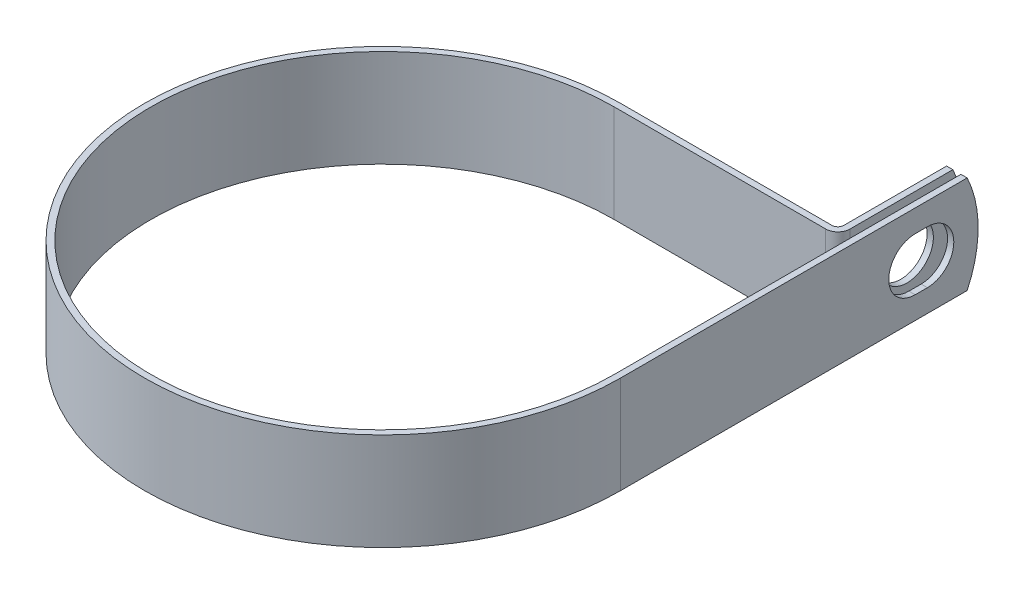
ISO-10303-21;
HEADER;
FILE_DESCRIPTION(('STEP AP214'),'2;1');
FILE_NAME('part.step','',(''),(''),'','','');
FILE_SCHEMA(('AUTOMOTIVE_DESIGN { 1 0 10303 214 1 1 1 1 }'));
ENDSEC;
DATA;
#1=APPLICATION_CONTEXT('core data for automotive mechanical design processes');
#2=APPLICATION_PROTOCOL_DEFINITION('international standard','automotive_design',2000,#1);
#3=PRODUCT_CONTEXT('',#1,'mechanical');
#4=PRODUCT('Part','Part','',(#3));
#5=PRODUCT_RELATED_PRODUCT_CATEGORY('part','',(#4));
#6=PRODUCT_DEFINITION_FORMATION('','',#4);
#7=PRODUCT_DEFINITION_CONTEXT('part definition',#1,'design');
#8=PRODUCT_DEFINITION('design','',#6,#7);
#9=PRODUCT_DEFINITION_SHAPE('','',#8);
#10=(LENGTH_UNIT() NAMED_UNIT(*) SI_UNIT(.MILLI.,.METRE.));
#11=(NAMED_UNIT(*) PLANE_ANGLE_UNIT() SI_UNIT($,.RADIAN.));
#12=(NAMED_UNIT(*) SI_UNIT($,.STERADIAN.) SOLID_ANGLE_UNIT());
#13=UNCERTAINTY_MEASURE_WITH_UNIT(LENGTH_MEASURE(1.E-05),#10,'distance_accuracy_value','');
#14=(GEOMETRIC_REPRESENTATION_CONTEXT(3) GLOBAL_UNCERTAINTY_ASSIGNED_CONTEXT((#13)) GLOBAL_UNIT_ASSIGNED_CONTEXT((#10,
#11,#12)) REPRESENTATION_CONTEXT('',''));
#15=CARTESIAN_POINT('',(0.,0.,0.));
#16=DIRECTION('',(0.,0.,1.));
#17=DIRECTION('',(1.,0.,0.));
#18=AXIS2_PLACEMENT_3D('',#15,#16,#17);
#19=CARTESIAN_POINT('',(45.2374,9.525,0.));
#20=DIRECTION('',(-1.,0.,0.));
#21=DIRECTION('',(0.,0.,1.));
#22=AXIS2_PLACEMENT_3D('',#19,#20,#21);
#23=PLANE('',#22);
#24=DIRECTION('',(0.,0.,-1.));
#25=VECTOR('',#24,1.);
#26=CARTESIAN_POINT('',(45.2374,-5.1562,-57.5309999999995));
#27=LINE('',#26,#25);
#28=CARTESIAN_POINT('',(45.2374,-5.1562,-57.5309999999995));
#29=VERTEX_POINT('',#28);
#30=CARTESIAN_POINT('',(45.2374,-5.1562,-59.9186000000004));
#31=VERTEX_POINT('',#30);
#32=EDGE_CURVE('E236',#29,#31,#27,.T.);
#33=ORIENTED_EDGE('',*,*,#32,.T.);
#34=CARTESIAN_POINT('',(45.2374,0.,-59.9185999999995));
#35=DIRECTION('',(-1.,0.,0.));
#36=DIRECTION('',(0.,0.,1.));
#37=AXIS2_PLACEMENT_3D('',#34,#35,#36);
#38=CIRCLE('',#37,5.1562);
#39=CARTESIAN_POINT('',(45.2374,5.1562,-59.9186000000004));
#40=VERTEX_POINT('',#39);
#41=EDGE_CURVE('E257',#31,#40,#38,.F.);
#42=ORIENTED_EDGE('',*,*,#41,.T.);
#43=DIRECTION('',(0.,0.,1.));
#44=VECTOR('',#43,1.);
#45=CARTESIAN_POINT('',(45.2374,5.1562,-57.5309999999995));
#46=LINE('',#45,#44);
#47=CARTESIAN_POINT('',(45.2374,5.1562,-57.5309999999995));
#48=VERTEX_POINT('',#47);
#49=EDGE_CURVE('E253',#40,#48,#46,.T.);
#50=ORIENTED_EDGE('',*,*,#49,.T.);
#51=CARTESIAN_POINT('',(45.2374,0.,-57.5309999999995));
#52=DIRECTION('',(-1.,0.,0.));
#53=DIRECTION('',(0.,0.,1.));
#54=AXIS2_PLACEMENT_3D('',#51,#52,#53);
#55=CIRCLE('',#54,5.1562);
#56=EDGE_CURVE('E248',#48,#29,#55,.F.);
#57=ORIENTED_EDGE('',*,*,#56,.T.);
#58=EDGE_LOOP('',(#33,#42,#50,#57));
#59=FACE_BOUND('',#58,.T.);
#60=CARTESIAN_POINT('',(45.2374,0.,-47.5996));
#61=DIRECTION('',(-1.,0.,0.));
#62=DIRECTION('',(0.,0.,1.));
#63=AXIS2_PLACEMENT_3D('',#60,#61,#62);
#64=CIRCLE('',#63,22.225);
#65=CARTESIAN_POINT('',(45.2374,9.525,-67.6800631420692));
#66=VERTEX_POINT('',#65);
#67=CARTESIAN_POINT('',(45.2374,-9.525,-67.6800631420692));
#68=VERTEX_POINT('',#67);
#69=EDGE_CURVE('E75',#66,#68,#64,.T.);
#70=ORIENTED_EDGE('',*,*,#69,.T.);
#71=DIRECTION('',(0.,0.,-1.));
#72=VECTOR('',#71,1.);
#73=CARTESIAN_POINT('',(45.2374,-9.525,0.));
#74=LINE('',#73,#72);
#75=CARTESIAN_POINT('',(45.2374,-9.525,0.));
#76=VERTEX_POINT('',#75);
#77=EDGE_CURVE('E271',#76,#68,#74,.T.);
#78=ORIENTED_EDGE('',*,*,#77,.F.);
#79=DIRECTION('',(0.,-1.,0.));
#80=VECTOR('',#79,1.);
#81=CARTESIAN_POINT('',(45.2374,9.525,0.));
#82=LINE('',#81,#80);
#83=CARTESIAN_POINT('',(45.2374,9.525,0.));
#84=VERTEX_POINT('',#83);
#85=EDGE_CURVE('E218',#84,#76,#82,.T.);
#86=ORIENTED_EDGE('',*,*,#85,.F.);
#87=DIRECTION('',(0.,0.,-1.));
#88=VECTOR('',#87,1.);
#89=CARTESIAN_POINT('',(45.2374,9.525,-45.2374));
#90=LINE('',#89,#88);
#91=EDGE_CURVE('E273',#84,#66,#90,.T.);
#92=ORIENTED_EDGE('',*,*,#91,.T.);
#93=EDGE_LOOP('',(#70,#78,#86,#92));
#94=FACE_BOUND('',#93,.T.);
#95=ADVANCED_FACE('F54',(#59,#94),#23,.T.);
#96=CARTESIAN_POINT('',(43.6626,9.525,-69.8246));
#97=DIRECTION('',(1.,0.,0.));
#98=DIRECTION('',(0.,0.,-1.));
#99=AXIS2_PLACEMENT_3D('',#96,#97,#98);
#100=PLANE('',#99);
#101=CARTESIAN_POINT('',(43.6626,0.,-58.7248));
#102=DIRECTION('',(1.,0.,0.));
#103=DIRECTION('',(0.,0.,-1.));
#104=AXIS2_PLACEMENT_3D('',#101,#102,#103);
#105=CIRCLE('',#104,5.1562);
#106=CARTESIAN_POINT('',(43.6626,0.,-63.881));
#107=VERTEX_POINT('',#106);
#108=EDGE_CURVE('E268',#107,#107,#105,.F.);
#109=ORIENTED_EDGE('',*,*,#108,.T.);
#110=EDGE_LOOP('',(#109));
#111=FACE_BOUND('',#110,.T.);
#112=DIRECTION('',(0.,0.,1.));
#113=VECTOR('',#112,1.);
#114=CARTESIAN_POINT('',(43.6626,-9.525,-69.8246));
#115=LINE('',#114,#113);
#116=CARTESIAN_POINT('',(43.6626,-9.525,-67.6800631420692));
#117=VERTEX_POINT('',#116);
#118=CARTESIAN_POINT('',(43.6626,-9.525,-47.61484));
#119=VERTEX_POINT('',#118);
#120=EDGE_CURVE('E184',#117,#119,#115,.T.);
#121=ORIENTED_EDGE('',*,*,#120,.F.);
#122=CARTESIAN_POINT('',(43.6626,0.,-47.5996));
#123=DIRECTION('',(1.,0.,0.));
#124=DIRECTION('',(0.,0.,-1.));
#125=AXIS2_PLACEMENT_3D('',#122,#123,#124);
#126=CIRCLE('',#125,22.225);
#127=CARTESIAN_POINT('',(43.6626,9.525,-67.6800631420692));
#128=VERTEX_POINT('',#127);
#129=EDGE_CURVE('E176',#117,#128,#126,.T.);
#130=ORIENTED_EDGE('',*,*,#129,.T.);
#131=DIRECTION('',(0.,0.,1.));
#132=VECTOR('',#131,1.);
#133=CARTESIAN_POINT('',(43.6626,9.525,-69.8246));
#134=LINE('',#133,#132);
#135=CARTESIAN_POINT('',(43.6626,9.525,-47.61484));
#136=VERTEX_POINT('',#135);
#137=EDGE_CURVE('E224',#128,#136,#134,.T.);
#138=ORIENTED_EDGE('',*,*,#137,.T.);
#139=DIRECTION('',(0.,-1.,0.));
#140=VECTOR('',#139,1.);
#141=CARTESIAN_POINT('',(43.6626,9.525,-47.61484));
#142=LINE('',#141,#140);
#143=EDGE_CURVE('E211',#136,#119,#142,.T.);
#144=ORIENTED_EDGE('',*,*,#143,.T.);
#145=EDGE_LOOP('',(#121,#130,#138,#144));
#146=FACE_BOUND('',#145,.T.);
#147=ADVANCED_FACE('F226',(#111,#146),#100,.T.);
#148=CARTESIAN_POINT('',(42.4434,9.525,-69.8246));
#149=DIRECTION('',(1.,0.,0.));
#150=DIRECTION('',(0.,0.,-1.));
#151=AXIS2_PLACEMENT_3D('',#148,#149,#150);
#152=PLANE('',#151);
#153=CARTESIAN_POINT('',(42.4434,0.,-58.7248));
#154=DIRECTION('',(-1.,0.,0.));
#155=DIRECTION('',(0.,0.,1.));
#156=AXIS2_PLACEMENT_3D('',#153,#154,#155);
#157=CIRCLE('',#156,5.1562);
#158=CARTESIAN_POINT('',(42.4434,0.,-53.5686));
#159=VERTEX_POINT('',#158);
#160=EDGE_CURVE('E265',#159,#159,#157,.T.);
#161=ORIENTED_EDGE('',*,*,#160,.F.);
#162=EDGE_LOOP('',(#161));
#163=FACE_BOUND('',#162,.T.);
#164=CARTESIAN_POINT('',(42.4434,0.,-47.5996));
#165=DIRECTION('',(-1.,0.,0.));
#166=DIRECTION('',(0.,0.,1.));
#167=AXIS2_PLACEMENT_3D('',#164,#165,#166);
#168=CIRCLE('',#167,22.225);
#169=CARTESIAN_POINT('',(42.4434,9.525,-67.6800631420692));
#170=VERTEX_POINT('',#169);
#171=CARTESIAN_POINT('',(42.4434,-9.525,-67.6800631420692));
#172=VERTEX_POINT('',#171);
#173=EDGE_CURVE('E67',#170,#172,#168,.T.);
#174=ORIENTED_EDGE('',*,*,#173,.T.);
#175=DIRECTION('',(0.,0.,1.));
#176=VECTOR('',#175,1.);
#177=CARTESIAN_POINT('',(42.4434,-9.525,-69.8246));
#178=LINE('',#177,#176);
#179=CARTESIAN_POINT('',(42.4434,-9.525,-47.61484));
#180=VERTEX_POINT('',#179);
#181=EDGE_CURVE('E167',#172,#180,#178,.T.);
#182=ORIENTED_EDGE('',*,*,#181,.T.);
#183=DIRECTION('',(0.,-1.,0.));
#184=VECTOR('',#183,1.);
#185=CARTESIAN_POINT('',(42.4434,9.525,-47.61484));
#186=LINE('',#185,#184);
#187=CARTESIAN_POINT('',(42.4434,9.525,-47.61484));
#188=VERTEX_POINT('',#187);
#189=EDGE_CURVE('E209',#188,#180,#186,.T.);
#190=ORIENTED_EDGE('',*,*,#189,.F.);
#191=DIRECTION('',(0.,0.,1.));
#192=VECTOR('',#191,1.);
#193=CARTESIAN_POINT('',(42.4434,9.525,-69.8246));
#194=LINE('',#193,#192);
#195=EDGE_CURVE('E169',#170,#188,#194,.T.);
#196=ORIENTED_EDGE('',*,*,#195,.F.);
#197=EDGE_LOOP('',(#174,#182,#190,#196));
#198=FACE_BOUND('',#197,.T.);
#199=ADVANCED_FACE('F164',(#163,#198),#152,.F.);
#200=CARTESIAN_POINT('',(46.4566,9.525,0.));
#201=DIRECTION('',(-1.,0.,0.));
#202=DIRECTION('',(0.,0.,1.));
#203=AXIS2_PLACEMENT_3D('',#200,#201,#202);
#204=PLANE('',#203);
#205=CARTESIAN_POINT('',(46.4566,0.,-59.9185999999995));
#206=DIRECTION('',(1.,0.,0.));
#207=DIRECTION('',(0.,0.,-1.));
#208=AXIS2_PLACEMENT_3D('',#205,#206,#207);
#209=CIRCLE('',#208,5.1562);
#210=CARTESIAN_POINT('',(46.4566,-5.1562,-59.9186000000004));
#211=VERTEX_POINT('',#210);
#212=CARTESIAN_POINT('',(46.4566,5.1562,-59.9186000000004));
#213=VERTEX_POINT('',#212);
#214=EDGE_CURVE('E237',#211,#213,#209,.T.);
#215=ORIENTED_EDGE('',*,*,#214,.F.);
#216=DIRECTION('',(0.,0.,-1.));
#217=VECTOR('',#216,1.);
#218=CARTESIAN_POINT('',(46.4566,-5.1562,-57.5309999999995));
#219=LINE('',#218,#217);
#220=CARTESIAN_POINT('',(46.4566,-5.1562,-57.5309999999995));
#221=VERTEX_POINT('',#220);
#222=EDGE_CURVE('E240',#221,#211,#219,.T.);
#223=ORIENTED_EDGE('',*,*,#222,.F.);
#224=CARTESIAN_POINT('',(46.4566,0.,-57.5309999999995));
#225=DIRECTION('',(1.,0.,0.));
#226=DIRECTION('',(0.,0.,-1.));
#227=AXIS2_PLACEMENT_3D('',#224,#225,#226);
#228=CIRCLE('',#227,5.1562);
#229=CARTESIAN_POINT('',(46.4566,5.1562,-57.5309999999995));
#230=VERTEX_POINT('',#229);
#231=EDGE_CURVE('E230',#230,#221,#228,.T.);
#232=ORIENTED_EDGE('',*,*,#231,.F.);
#233=DIRECTION('',(0.,0.,1.));
#234=VECTOR('',#233,1.);
#235=CARTESIAN_POINT('',(46.4566,5.1562,-57.5309999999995));
#236=LINE('',#235,#234);
#237=EDGE_CURVE('E234',#213,#230,#236,.T.);
#238=ORIENTED_EDGE('',*,*,#237,.F.);
#239=EDGE_LOOP('',(#215,#223,#232,#238));
#240=FACE_BOUND('',#239,.T.);
#241=DIRECTION('',(0.,0.,-1.));
#242=VECTOR('',#241,1.);
#243=CARTESIAN_POINT('',(46.4566,-9.525,0.));
#244=LINE('',#243,#242);
#245=CARTESIAN_POINT('',(46.4566,-9.525,0.));
#246=VERTEX_POINT('',#245);
#247=CARTESIAN_POINT('',(46.4566,-9.525,-67.6800631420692));
#248=VERTEX_POINT('',#247);
#249=EDGE_CURVE('E195',#246,#248,#244,.T.);
#250=ORIENTED_EDGE('',*,*,#249,.T.);
#251=CARTESIAN_POINT('',(46.4566,0.,-47.5996));
#252=DIRECTION('',(-1.,0.,0.));
#253=DIRECTION('',(0.,0.,1.));
#254=AXIS2_PLACEMENT_3D('',#251,#252,#253);
#255=CIRCLE('',#254,22.225);
#256=CARTESIAN_POINT('',(46.4566,9.525,-67.6800631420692));
#257=VERTEX_POINT('',#256);
#258=EDGE_CURVE('E170',#257,#248,#255,.T.);
#259=ORIENTED_EDGE('',*,*,#258,.F.);
#260=DIRECTION('',(0.,0.,-1.));
#261=VECTOR('',#260,1.);
#262=CARTESIAN_POINT('',(46.4566,9.525,-45.2374));
#263=LINE('',#262,#261);
#264=CARTESIAN_POINT('',(46.4566,9.525,0.));
#265=VERTEX_POINT('',#264);
#266=EDGE_CURVE('E198',#265,#257,#263,.T.);
#267=ORIENTED_EDGE('',*,*,#266,.F.);
#268=DIRECTION('',(0.,-1.,0.));
#269=VECTOR('',#268,1.);
#270=CARTESIAN_POINT('',(46.4566,9.525,0.));
#271=LINE('',#270,#269);
#272=EDGE_CURVE('E199',#265,#246,#271,.T.);
#273=ORIENTED_EDGE('',*,*,#272,.T.);
#274=EDGE_LOOP('',(#250,#259,#267,#273));
#275=FACE_BOUND('',#274,.T.);
#276=ADVANCED_FACE('F321',(#240,#275),#204,.F.);
#277=CARTESIAN_POINT('',(0.,-9.525,0.));
#278=DIRECTION('',(0.,1.,0.));
#279=DIRECTION('',(1.,0.,0.));
#280=AXIS2_PLACEMENT_3D('',#277,#278,#279);
#281=PLANE('',#280);
#282=DIRECTION('',(-1.,0.,0.));
#283=VECTOR('',#282,1.);
#284=CARTESIAN_POINT('',(46.4566,-9.525,-67.6800631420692));
#285=LINE('',#284,#283);
#286=EDGE_CURVE('E171',#248,#68,#285,.T.);
#287=ORIENTED_EDGE('',*,*,#286,.F.);
#288=ORIENTED_EDGE('',*,*,#249,.F.);
#289=CARTESIAN_POINT('',(0.,-9.525,0.));
#290=DIRECTION('',(0.,1.,0.));
#291=DIRECTION('',(1.,0.,0.));
#292=AXIS2_PLACEMENT_3D('',#289,#290,#291);
#293=CIRCLE('',#292,46.4566);
#294=CARTESIAN_POINT('',(0.,-9.525,-46.4566));
#295=VERTEX_POINT('',#294);
#296=EDGE_CURVE('E193',#295,#246,#293,.T.);
#297=ORIENTED_EDGE('',*,*,#296,.F.);
#298=DIRECTION('',(1.,0.,0.));
#299=VECTOR('',#298,1.);
#300=CARTESIAN_POINT('',(0.,-9.525,-46.4566));
#301=LINE('',#300,#299);
#302=CARTESIAN_POINT('',(41.28516,-9.525,-46.4566));
#303=VERTEX_POINT('',#302);
#304=EDGE_CURVE('E186',#303,#295,#301,.F.);
#305=ORIENTED_EDGE('',*,*,#304,.F.);
#306=CARTESIAN_POINT('',(41.28516,-9.525,-47.61484));
#307=DIRECTION('',(0.,1.,0.));
#308=DIRECTION('',(1.,0.,0.));
#309=AXIS2_PLACEMENT_3D('',#306,#307,#308);
#310=CIRCLE('',#309,1.15824000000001);
#311=EDGE_CURVE('E183',#180,#303,#310,.F.);
#312=ORIENTED_EDGE('',*,*,#311,.F.);
#313=ORIENTED_EDGE('',*,*,#181,.F.);
#314=DIRECTION('',(-1.,0.,0.));
#315=VECTOR('',#314,1.);
#316=CARTESIAN_POINT('',(46.4566,-9.525,-67.6800631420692));
#317=LINE('',#316,#315);
#318=EDGE_CURVE('E12',#117,#172,#317,.T.);
#319=ORIENTED_EDGE('',*,*,#318,.F.);
#320=ORIENTED_EDGE('',*,*,#120,.T.);
#321=CARTESIAN_POINT('',(41.28516,-9.525,-47.61484));
#322=DIRECTION('',(0.,-1.,0.));
#323=DIRECTION('',(0.,0.,1.));
#324=AXIS2_PLACEMENT_3D('',#321,#322,#323);
#325=CIRCLE('',#324,2.37744);
#326=CARTESIAN_POINT('',(41.28516,-9.525,-45.2374));
#327=VERTEX_POINT('',#326);
#328=EDGE_CURVE('E188',#119,#327,#325,.T.);
#329=ORIENTED_EDGE('',*,*,#328,.T.);
#330=DIRECTION('',(-1.,0.,0.));
#331=VECTOR('',#330,1.);
#332=CARTESIAN_POINT('',(0.,-9.525,-45.2374));
#333=LINE('',#332,#331);
#334=CARTESIAN_POINT('',(0.,-9.525,-45.2374));
#335=VERTEX_POINT('',#334);
#336=EDGE_CURVE('E298',#327,#335,#333,.T.);
#337=ORIENTED_EDGE('',*,*,#336,.T.);
#338=CARTESIAN_POINT('',(0.,-9.525,0.));
#339=DIRECTION('',(0.,1.,0.));
#340=DIRECTION('',(0.,0.,1.));
#341=AXIS2_PLACEMENT_3D('',#338,#339,#340);
#342=CIRCLE('',#341,45.2374);
#343=EDGE_CURVE('E295',#335,#76,#342,.T.);
#344=ORIENTED_EDGE('',*,*,#343,.T.);
#345=ORIENTED_EDGE('',*,*,#77,.T.);
#346=EDGE_LOOP('',(#287,#288,#297,#305,#312,#313,#319,#320,#329,#337,#344,#345));
#347=FACE_BOUND('',#346,.T.);
#348=ADVANCED_FACE('F181',(#347),#281,.F.);
#349=CARTESIAN_POINT('',(0.,9.525,0.));
#350=DIRECTION('',(0.,1.,0.));
#351=DIRECTION('',(1.,0.,0.));
#352=AXIS2_PLACEMENT_3D('',#349,#350,#351);
#353=PLANE('',#352);
#354=ORIENTED_EDGE('',*,*,#266,.T.);
#355=DIRECTION('',(-1.,0.,0.));
#356=VECTOR('',#355,1.);
#357=CARTESIAN_POINT('',(46.4566,9.525,-67.6800631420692));
#358=LINE('',#357,#356);
#359=EDGE_CURVE('E228',#257,#66,#358,.T.);
#360=ORIENTED_EDGE('',*,*,#359,.T.);
#361=ORIENTED_EDGE('',*,*,#91,.F.);
#362=CARTESIAN_POINT('',(0.,9.525,0.));
#363=DIRECTION('',(0.,1.,0.));
#364=DIRECTION('',(0.,0.,1.));
#365=AXIS2_PLACEMENT_3D('',#362,#363,#364);
#366=CIRCLE('',#365,45.2374);
#367=CARTESIAN_POINT('',(0.,9.525,-45.2374));
#368=VERTEX_POINT('',#367);
#369=EDGE_CURVE('E276',#368,#84,#366,.T.);
#370=ORIENTED_EDGE('',*,*,#369,.F.);
#371=DIRECTION('',(-1.,0.,0.));
#372=VECTOR('',#371,1.);
#373=CARTESIAN_POINT('',(0.,9.525,-45.2374));
#374=LINE('',#373,#372);
#375=CARTESIAN_POINT('',(41.28516,9.525,-45.2374));
#376=VERTEX_POINT('',#375);
#377=EDGE_CURVE('E279',#376,#368,#374,.T.);
#378=ORIENTED_EDGE('',*,*,#377,.F.);
#379=CARTESIAN_POINT('',(41.28516,9.525,-47.61484));
#380=DIRECTION('',(0.,-1.,0.));
#381=DIRECTION('',(0.,0.,1.));
#382=AXIS2_PLACEMENT_3D('',#379,#380,#381);
#383=CIRCLE('',#382,2.37744);
#384=EDGE_CURVE('E282',#136,#376,#383,.T.);
#385=ORIENTED_EDGE('',*,*,#384,.F.);
#386=ORIENTED_EDGE('',*,*,#137,.F.);
#387=DIRECTION('',(-1.,0.,0.));
#388=VECTOR('',#387,1.);
#389=CARTESIAN_POINT('',(46.4566,9.525,-67.6800631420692));
#390=LINE('',#389,#388);
#391=EDGE_CURVE('E61',#128,#170,#390,.T.);
#392=ORIENTED_EDGE('',*,*,#391,.T.);
#393=ORIENTED_EDGE('',*,*,#195,.T.);
#394=CARTESIAN_POINT('',(41.28516,9.525,-47.61484));
#395=DIRECTION('',(0.,1.,0.));
#396=DIRECTION('',(1.,0.,0.));
#397=AXIS2_PLACEMENT_3D('',#394,#395,#396);
#398=CIRCLE('',#397,1.15824000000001);
#399=CARTESIAN_POINT('',(41.28516,9.525,-46.4566));
#400=VERTEX_POINT('',#399);
#401=EDGE_CURVE('E287',#188,#400,#398,.F.);
#402=ORIENTED_EDGE('',*,*,#401,.T.);
#403=DIRECTION('',(1.,0.,0.));
#404=VECTOR('',#403,1.);
#405=CARTESIAN_POINT('',(0.,9.525,-46.4566));
#406=LINE('',#405,#404);
#407=CARTESIAN_POINT('',(0.,9.525,-46.4566));
#408=VERTEX_POINT('',#407);
#409=EDGE_CURVE('E289',#400,#408,#406,.F.);
#410=ORIENTED_EDGE('',*,*,#409,.T.);
#411=CARTESIAN_POINT('',(0.,9.525,0.));
#412=DIRECTION('',(0.,1.,0.));
#413=DIRECTION('',(1.,0.,0.));
#414=AXIS2_PLACEMENT_3D('',#411,#412,#413);
#415=CIRCLE('',#414,46.4566);
#416=EDGE_CURVE('E203',#408,#265,#415,.T.);
#417=ORIENTED_EDGE('',*,*,#416,.T.);
#418=EDGE_LOOP('',(#354,#360,#361,#370,#378,#385,#386,#392,#393,#402,#410,#417));
#419=FACE_BOUND('',#418,.T.);
#420=ADVANCED_FACE('F222',(#419),#353,.T.);
#421=CARTESIAN_POINT('',(0.,9.525,0.));
#422=DIRECTION('',(0.,-1.,0.));
#423=DIRECTION('',(0.,0.,-1.));
#424=AXIS2_PLACEMENT_3D('',#421,#422,#423);
#425=CYLINDRICAL_SURFACE('',#424,45.2374);
#426=ORIENTED_EDGE('',*,*,#343,.F.);
#427=DIRECTION('',(0.,-1.,0.));
#428=VECTOR('',#427,1.);
#429=CARTESIAN_POINT('',(0.,9.525,-45.2374));
#430=LINE('',#429,#428);
#431=EDGE_CURVE('E216',#368,#335,#430,.T.);
#432=ORIENTED_EDGE('',*,*,#431,.F.);
#433=ORIENTED_EDGE('',*,*,#369,.T.);
#434=ORIENTED_EDGE('',*,*,#85,.T.);
#435=EDGE_LOOP('',(#426,#432,#433,#434));
#436=FACE_BOUND('',#435,.T.);
#437=ADVANCED_FACE('F311',(#436),#425,.F.);
#438=CARTESIAN_POINT('',(0.,9.525,-45.2374));
#439=DIRECTION('',(0.,0.,1.));
#440=DIRECTION('',(1.,0.,0.));
#441=AXIS2_PLACEMENT_3D('',#438,#439,#440);
#442=PLANE('',#441);
#443=ORIENTED_EDGE('',*,*,#336,.F.);
#444=DIRECTION('',(0.,-1.,0.));
#445=VECTOR('',#444,1.);
#446=CARTESIAN_POINT('',(41.28516,9.525,-45.2374));
#447=LINE('',#446,#445);
#448=EDGE_CURVE('E214',#376,#327,#447,.T.);
#449=ORIENTED_EDGE('',*,*,#448,.F.);
#450=ORIENTED_EDGE('',*,*,#377,.T.);
#451=ORIENTED_EDGE('',*,*,#431,.T.);
#452=EDGE_LOOP('',(#443,#449,#450,#451));
#453=FACE_BOUND('',#452,.T.);
#454=ADVANCED_FACE('F307',(#453),#442,.T.);
#455=CARTESIAN_POINT('',(41.28516,9.525,-47.61484));
#456=DIRECTION('',(0.,-1.,0.));
#457=DIRECTION('',(0.,0.,-1.));
#458=AXIS2_PLACEMENT_3D('',#455,#456,#457);
#459=CYLINDRICAL_SURFACE('',#458,2.37744);
#460=ORIENTED_EDGE('',*,*,#328,.F.);
#461=ORIENTED_EDGE('',*,*,#143,.F.);
#462=ORIENTED_EDGE('',*,*,#384,.T.);
#463=ORIENTED_EDGE('',*,*,#448,.T.);
#464=EDGE_LOOP('',(#460,#461,#462,#463));
#465=FACE_BOUND('',#464,.T.);
#466=ADVANCED_FACE('F304',(#465),#459,.T.);
#467=CARTESIAN_POINT('',(41.28516,9.525,-47.61484));
#468=DIRECTION('',(0.,-1.,0.));
#469=DIRECTION('',(0.,0.,-1.));
#470=AXIS2_PLACEMENT_3D('',#467,#468,#469);
#471=CYLINDRICAL_SURFACE('',#470,1.15824000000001);
#472=ORIENTED_EDGE('',*,*,#311,.T.);
#473=DIRECTION('',(0.,-1.,0.));
#474=VECTOR('',#473,1.);
#475=CARTESIAN_POINT('',(41.28516,9.525,-46.4566));
#476=LINE('',#475,#474);
#477=EDGE_CURVE('E206',#400,#303,#476,.T.);
#478=ORIENTED_EDGE('',*,*,#477,.F.);
#479=ORIENTED_EDGE('',*,*,#401,.F.);
#480=ORIENTED_EDGE('',*,*,#189,.T.);
#481=EDGE_LOOP('',(#472,#478,#479,#480));
#482=FACE_BOUND('',#481,.T.);
#483=ADVANCED_FACE('F334',(#482),#471,.F.);
#484=CARTESIAN_POINT('',(0.,9.525,-46.4566));
#485=DIRECTION('',(0.,0.,1.));
#486=DIRECTION('',(1.,0.,0.));
#487=AXIS2_PLACEMENT_3D('',#484,#485,#486);
#488=PLANE('',#487);
#489=ORIENTED_EDGE('',*,*,#304,.T.);
#490=DIRECTION('',(0.,-1.,0.));
#491=VECTOR('',#490,1.);
#492=CARTESIAN_POINT('',(0.,9.525,-46.4566));
#493=LINE('',#492,#491);
#494=EDGE_CURVE('E202',#408,#295,#493,.T.);
#495=ORIENTED_EDGE('',*,*,#494,.F.);
#496=ORIENTED_EDGE('',*,*,#409,.F.);
#497=ORIENTED_EDGE('',*,*,#477,.T.);
#498=EDGE_LOOP('',(#489,#495,#496,#497));
#499=FACE_BOUND('',#498,.T.);
#500=ADVANCED_FACE('F330',(#499),#488,.F.);
#501=CARTESIAN_POINT('',(0.,9.525,0.));
#502=DIRECTION('',(0.,-1.,0.));
#503=DIRECTION('',(0.,0.,-1.));
#504=AXIS2_PLACEMENT_3D('',#501,#502,#503);
#505=CYLINDRICAL_SURFACE('',#504,46.4566);
#506=ORIENTED_EDGE('',*,*,#296,.T.);
#507=ORIENTED_EDGE('',*,*,#272,.F.);
#508=ORIENTED_EDGE('',*,*,#416,.F.);
#509=ORIENTED_EDGE('',*,*,#494,.T.);
#510=EDGE_LOOP('',(#506,#507,#508,#509));
#511=FACE_BOUND('',#510,.T.);
#512=ADVANCED_FACE('F327',(#511),#505,.T.);
#513=CARTESIAN_POINT('',(58.2465359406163,0.,-58.7248));
#514=DIRECTION('',(-1.,0.,0.));
#515=DIRECTION('',(0.,0.,1.));
#516=AXIS2_PLACEMENT_3D('',#513,#514,#515);
#517=CYLINDRICAL_SURFACE('',#516,5.1562);
#518=ORIENTED_EDGE('',*,*,#160,.T.);
#519=EDGE_LOOP('',(#518));
#520=FACE_BOUND('',#519,.T.);
#521=ORIENTED_EDGE('',*,*,#108,.F.);
#522=EDGE_LOOP('',(#521));
#523=FACE_BOUND('',#522,.T.);
#524=ADVANCED_FACE('F379',(#520,#523),#517,.F.);
#525=CARTESIAN_POINT('',(28.87782806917,-5.1562,-57.5309999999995));
#526=DIRECTION('',(0.,-1.,0.));
#527=DIRECTION('',(0.,0.,-1.));
#528=AXIS2_PLACEMENT_3D('',#525,#526,#527);
#529=PLANE('',#528);
#530=DIRECTION('',(1.,0.,0.));
#531=VECTOR('',#530,1.);
#532=CARTESIAN_POINT('',(28.87782806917,-5.1562,-57.5309999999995));
#533=LINE('',#532,#531);
#534=EDGE_CURVE('E251',#29,#221,#533,.T.);
#535=ORIENTED_EDGE('',*,*,#534,.T.);
#536=ORIENTED_EDGE('',*,*,#222,.T.);
#537=DIRECTION('',(1.,0.,0.));
#538=VECTOR('',#537,1.);
#539=CARTESIAN_POINT('',(28.87782806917,-5.1562,-59.9186000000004));
#540=LINE('',#539,#538);
#541=EDGE_CURVE('E247',#31,#211,#540,.T.);
#542=ORIENTED_EDGE('',*,*,#541,.F.);
#543=ORIENTED_EDGE('',*,*,#32,.F.);
#544=EDGE_LOOP('',(#535,#536,#542,#543));
#545=FACE_BOUND('',#544,.T.);
#546=ADVANCED_FACE('F354',(#545),#529,.F.);
#547=CARTESIAN_POINT('',(28.87782806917,0.,-59.9185999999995));
#548=DIRECTION('',(1.,0.,0.));
#549=DIRECTION('',(0.,0.,-1.));
#550=AXIS2_PLACEMENT_3D('',#547,#548,#549);
#551=CYLINDRICAL_SURFACE('',#550,5.1562);
#552=ORIENTED_EDGE('',*,*,#541,.T.);
#553=ORIENTED_EDGE('',*,*,#214,.T.);
#554=DIRECTION('',(1.,0.,0.));
#555=VECTOR('',#554,1.);
#556=CARTESIAN_POINT('',(28.87782806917,5.1562,-59.9186000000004));
#557=LINE('',#556,#555);
#558=EDGE_CURVE('E256',#40,#213,#557,.T.);
#559=ORIENTED_EDGE('',*,*,#558,.F.);
#560=ORIENTED_EDGE('',*,*,#41,.F.);
#561=EDGE_LOOP('',(#552,#553,#559,#560));
#562=FACE_BOUND('',#561,.T.);
#563=ADVANCED_FACE('F358',(#562),#551,.F.);
#564=CARTESIAN_POINT('',(28.87782806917,5.1562,-57.5309999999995));
#565=DIRECTION('',(0.,1.,0.));
#566=DIRECTION('',(0.,0.,1.));
#567=AXIS2_PLACEMENT_3D('',#564,#565,#566);
#568=PLANE('',#567);
#569=ORIENTED_EDGE('',*,*,#558,.T.);
#570=ORIENTED_EDGE('',*,*,#237,.T.);
#571=DIRECTION('',(1.,0.,0.));
#572=VECTOR('',#571,1.);
#573=CARTESIAN_POINT('',(28.87782806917,5.1562,-57.5309999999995));
#574=LINE('',#573,#572);
#575=EDGE_CURVE('E252',#48,#230,#574,.T.);
#576=ORIENTED_EDGE('',*,*,#575,.F.);
#577=ORIENTED_EDGE('',*,*,#49,.F.);
#578=EDGE_LOOP('',(#569,#570,#576,#577));
#579=FACE_BOUND('',#578,.T.);
#580=ADVANCED_FACE('F362',(#579),#568,.F.);
#581=CARTESIAN_POINT('',(28.87782806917,0.,-57.5309999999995));
#582=DIRECTION('',(1.,0.,0.));
#583=DIRECTION('',(0.,0.,-1.));
#584=AXIS2_PLACEMENT_3D('',#581,#582,#583);
#585=CYLINDRICAL_SURFACE('',#584,5.1562);
#586=ORIENTED_EDGE('',*,*,#575,.T.);
#587=ORIENTED_EDGE('',*,*,#231,.T.);
#588=ORIENTED_EDGE('',*,*,#534,.F.);
#589=ORIENTED_EDGE('',*,*,#56,.F.);
#590=EDGE_LOOP('',(#586,#587,#588,#589));
#591=FACE_BOUND('',#590,.T.);
#592=ADVANCED_FACE('F366',(#591),#585,.F.);
#593=CARTESIAN_POINT('',(46.4566,0.,-47.5996));
#594=DIRECTION('',(-1.,0.,0.));
#595=DIRECTION('',(0.,0.,1.));
#596=AXIS2_PLACEMENT_3D('',#593,#594,#595);
#597=CYLINDRICAL_SURFACE('',#596,22.225);
#598=ORIENTED_EDGE('',*,*,#129,.F.);
#599=ORIENTED_EDGE('',*,*,#318,.T.);
#600=ORIENTED_EDGE('',*,*,#173,.F.);
#601=ORIENTED_EDGE('',*,*,#391,.F.);
#602=EDGE_LOOP('',(#598,#599,#600,#601));
#603=FACE_BOUND('',#602,.T.);
#604=ADVANCED_FACE('F174',(#603),#597,.T.);
#605=ORIENTED_EDGE('',*,*,#359,.F.);
#606=ORIENTED_EDGE('',*,*,#258,.T.);
#607=ORIENTED_EDGE('',*,*,#286,.T.);
#608=ORIENTED_EDGE('',*,*,#69,.F.);
#609=EDGE_LOOP('',(#605,#606,#607,#608));
#610=FACE_BOUND('',#609,.T.);
#611=ADVANCED_FACE('F316',(#610),#597,.T.);
#612=CLOSED_SHELL('',(#95,#147,#199,#276,#348,#420,#437,#454,#466,#483,#500,#512,#524,#546,#563,
#580,#592,#604,#611));
#613=MANIFOLD_SOLID_BREP('B2',#612);
#614=ADVANCED_BREP_SHAPE_REPRESENTATION('',(#18,#613),#14);
#615=SHAPE_DEFINITION_REPRESENTATION(#9,#614);
ENDSEC;
END-ISO-10303-21;
